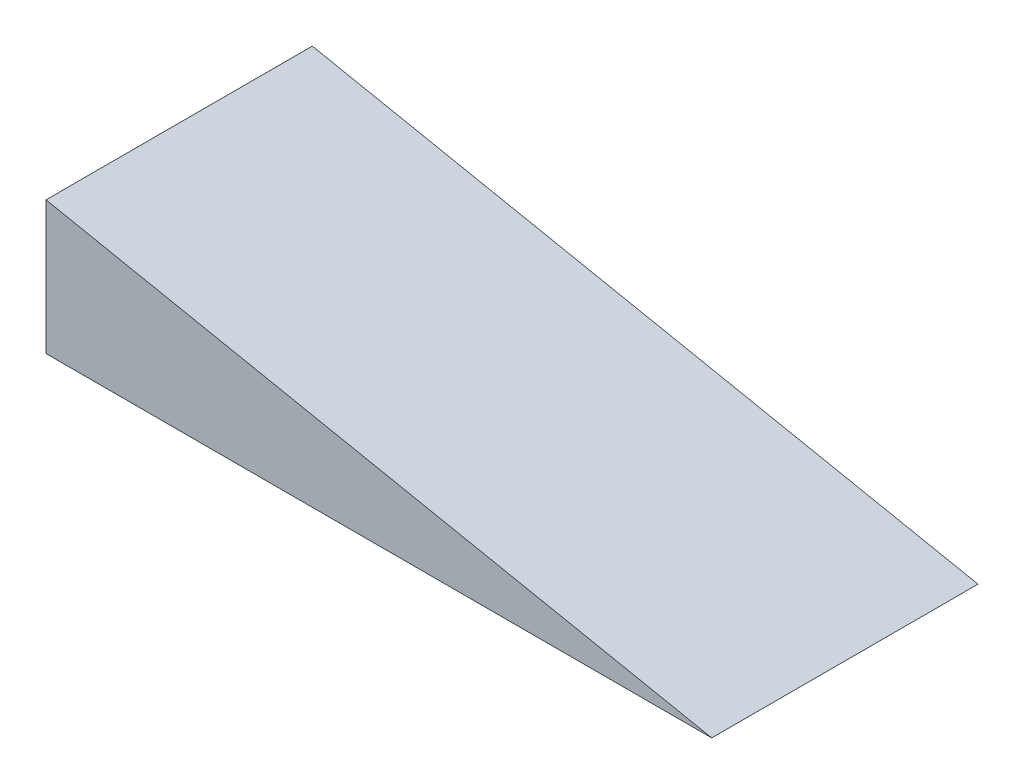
from build123d import *

# Parameters (mm, degrees)
BOSS_EXTRUDE2_DEPTH = 4


with BuildPart() as part:
    # Sketch2 → Boss-Extrude2 (new body)
    with BuildSketch(Plane.XY):
        Polygon((0, 0), (10, 0), (0, 2), align=None)
    extrude(amount=BOSS_EXTRUDE2_DEPTH)


solid = part.part
